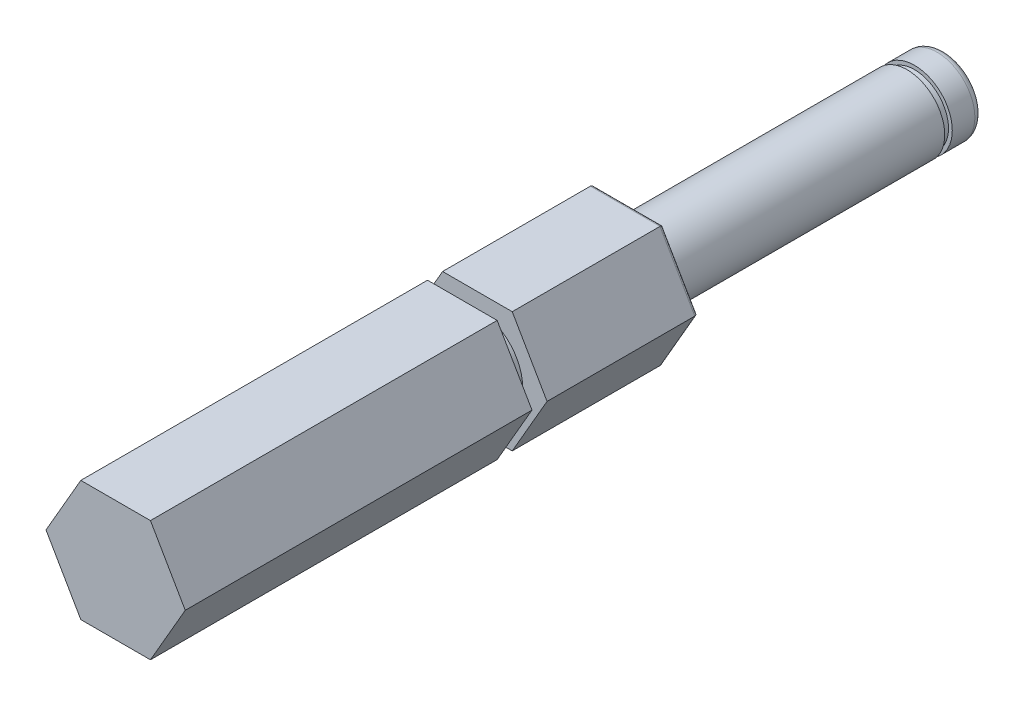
ISO-10303-21;
HEADER;
FILE_DESCRIPTION(('STEP AP214'),'2;1');
FILE_NAME('part.step','',(''),(''),'','','');
FILE_SCHEMA(('AUTOMOTIVE_DESIGN { 1 0 10303 214 1 1 1 1 }'));
ENDSEC;
DATA;
#1=APPLICATION_CONTEXT('core data for automotive mechanical design processes');
#2=APPLICATION_PROTOCOL_DEFINITION('international standard','automotive_design',2000,#1);
#3=PRODUCT_CONTEXT('',#1,'mechanical');
#4=PRODUCT('Part','Part','',(#3));
#5=PRODUCT_RELATED_PRODUCT_CATEGORY('part','',(#4));
#6=PRODUCT_DEFINITION_FORMATION('','',#4);
#7=PRODUCT_DEFINITION_CONTEXT('part definition',#1,'design');
#8=PRODUCT_DEFINITION('design','',#6,#7);
#9=PRODUCT_DEFINITION_SHAPE('','',#8);
#10=(LENGTH_UNIT() NAMED_UNIT(*) SI_UNIT(.MILLI.,.METRE.));
#11=(NAMED_UNIT(*) PLANE_ANGLE_UNIT() SI_UNIT($,.RADIAN.));
#12=(NAMED_UNIT(*) SI_UNIT($,.STERADIAN.) SOLID_ANGLE_UNIT());
#13=UNCERTAINTY_MEASURE_WITH_UNIT(LENGTH_MEASURE(1.E-05),#10,'distance_accuracy_value','');
#14=(GEOMETRIC_REPRESENTATION_CONTEXT(3) GLOBAL_UNCERTAINTY_ASSIGNED_CONTEXT((#13)) GLOBAL_UNIT_ASSIGNED_CONTEXT((#10,
#11,#12)) REPRESENTATION_CONTEXT('',''));
#15=CARTESIAN_POINT('',(0.,0.,0.));
#16=DIRECTION('',(0.,0.,1.));
#17=DIRECTION('',(1.,0.,0.));
#18=AXIS2_PLACEMENT_3D('',#15,#16,#17);
#19=CARTESIAN_POINT('',(0.,0.,-55.));
#20=DIRECTION('',(0.,0.,1.));
#21=DIRECTION('',(1.,0.,0.));
#22=AXIS2_PLACEMENT_3D('',#19,#20,#21);
#23=CYLINDRICAL_SURFACE('',#22,2.5);
#24=CARTESIAN_POINT('',(0.,0.,-52.5));
#25=DIRECTION('',(0.,0.,1.));
#26=DIRECTION('',(1.,0.,0.));
#27=AXIS2_PLACEMENT_3D('',#24,#25,#26);
#28=CIRCLE('',#27,2.5);
#29=CARTESIAN_POINT('',(2.5,0.,-52.5));
#30=VERTEX_POINT('',#29);
#31=EDGE_CURVE('E483',#30,#30,#28,.T.);
#32=CARTESIAN_POINT('',(0.,0.,-34.));
#33=DIRECTION('',(0.,0.,1.));
#34=DIRECTION('',(1.,0.,0.));
#35=AXIS2_PLACEMENT_3D('',#32,#33,#34);
#36=CIRCLE('',#35,2.5);
#37=CARTESIAN_POINT('',(2.5,0.,-34.));
#38=VERTEX_POINT('',#37);
#39=EDGE_CURVE('E236',#38,#38,#36,.F.);
#40=CARTESIAN_POINT('',(2.5,0.,-52.5));
#41=CARTESIAN_POINT('',(2.5,0.,-52.3072916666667));
#42=CARTESIAN_POINT('',(2.5,0.,-52.1145833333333));
#43=CARTESIAN_POINT('',(2.5,0.,-51.7291666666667));
#44=CARTESIAN_POINT('',(2.5,0.,-51.5364583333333));
#45=CARTESIAN_POINT('',(2.5,0.,-51.1510416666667));
#46=CARTESIAN_POINT('',(2.5,0.,-50.9583333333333));
#47=CARTESIAN_POINT('',(2.5,0.,-50.5729166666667));
#48=CARTESIAN_POINT('',(2.5,0.,-50.3802083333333));
#49=CARTESIAN_POINT('',(2.5,0.,-49.9947916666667));
#50=CARTESIAN_POINT('',(2.5,0.,-49.8020833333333));
#51=CARTESIAN_POINT('',(2.5,0.,-49.4166666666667));
#52=CARTESIAN_POINT('',(2.5,0.,-49.2239583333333));
#53=CARTESIAN_POINT('',(2.5,0.,-48.8385416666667));
#54=CARTESIAN_POINT('',(2.5,0.,-48.6458333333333));
#55=CARTESIAN_POINT('',(2.5,0.,-48.2604166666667));
#56=CARTESIAN_POINT('',(2.5,0.,-48.0677083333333));
#57=CARTESIAN_POINT('',(2.5,0.,-47.6822916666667));
#58=CARTESIAN_POINT('',(2.5,0.,-47.4895833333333));
#59=CARTESIAN_POINT('',(2.5,0.,-47.1041666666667));
#60=CARTESIAN_POINT('',(2.5,0.,-46.9114583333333));
#61=CARTESIAN_POINT('',(2.5,0.,-46.5260416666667));
#62=CARTESIAN_POINT('',(2.5,0.,-46.3333333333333));
#63=CARTESIAN_POINT('',(2.5,0.,-45.9479166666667));
#64=CARTESIAN_POINT('',(2.5,0.,-45.7552083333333));
#65=CARTESIAN_POINT('',(2.5,0.,-45.3697916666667));
#66=CARTESIAN_POINT('',(2.5,0.,-45.1770833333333));
#67=CARTESIAN_POINT('',(2.5,0.,-44.7916666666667));
#68=CARTESIAN_POINT('',(2.5,0.,-44.5989583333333));
#69=CARTESIAN_POINT('',(2.5,0.,-44.2135416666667));
#70=CARTESIAN_POINT('',(2.5,0.,-44.0208333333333));
#71=CARTESIAN_POINT('',(2.5,0.,-43.6354166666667));
#72=CARTESIAN_POINT('',(2.5,0.,-43.4427083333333));
#73=CARTESIAN_POINT('',(2.5,0.,-43.0572916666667));
#74=CARTESIAN_POINT('',(2.5,0.,-42.8645833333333));
#75=CARTESIAN_POINT('',(2.5,0.,-42.4791666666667));
#76=CARTESIAN_POINT('',(2.5,0.,-42.2864583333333));
#77=CARTESIAN_POINT('',(2.5,0.,-41.9010416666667));
#78=CARTESIAN_POINT('',(2.5,0.,-41.7083333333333));
#79=CARTESIAN_POINT('',(2.5,0.,-41.3229166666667));
#80=CARTESIAN_POINT('',(2.5,0.,-41.1302083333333));
#81=CARTESIAN_POINT('',(2.5,0.,-40.7447916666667));
#82=CARTESIAN_POINT('',(2.5,0.,-40.5520833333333));
#83=CARTESIAN_POINT('',(2.5,0.,-40.1666666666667));
#84=CARTESIAN_POINT('',(2.5,0.,-39.9739583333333));
#85=CARTESIAN_POINT('',(2.5,0.,-39.5885416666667));
#86=CARTESIAN_POINT('',(2.5,0.,-39.3958333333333));
#87=CARTESIAN_POINT('',(2.5,0.,-39.0104166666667));
#88=CARTESIAN_POINT('',(2.5,0.,-38.8177083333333));
#89=CARTESIAN_POINT('',(2.5,0.,-38.4322916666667));
#90=CARTESIAN_POINT('',(2.5,0.,-38.2395833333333));
#91=CARTESIAN_POINT('',(2.5,0.,-37.8541666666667));
#92=CARTESIAN_POINT('',(2.5,0.,-37.6614583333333));
#93=CARTESIAN_POINT('',(2.5,0.,-37.2760416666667));
#94=CARTESIAN_POINT('',(2.5,0.,-37.0833333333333));
#95=CARTESIAN_POINT('',(2.5,0.,-36.6979166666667));
#96=CARTESIAN_POINT('',(2.5,0.,-36.5052083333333));
#97=CARTESIAN_POINT('',(2.5,0.,-36.1197916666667));
#98=CARTESIAN_POINT('',(2.5,0.,-35.9270833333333));
#99=CARTESIAN_POINT('',(2.5,0.,-35.5416666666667));
#100=CARTESIAN_POINT('',(2.5,0.,-35.3489583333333));
#101=CARTESIAN_POINT('',(2.5,0.,-34.9635416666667));
#102=CARTESIAN_POINT('',(2.5,0.,-34.7708333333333));
#103=CARTESIAN_POINT('',(2.5,0.,-34.3854166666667));
#104=CARTESIAN_POINT('',(2.5,0.,-34.1927083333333));
#105=CARTESIAN_POINT('',(2.5,0.,-34.));
#106=B_SPLINE_CURVE_WITH_KNOTS('',3,(#40,#41,#42,#43,#44,#45,#46,#47,#48,#49,#50,#51,#52,#53,
#54,#55,#56,#57,#58,#59,#60,#61,#62,#63,#64,#65,#66,#67,#68,#69,#70,#71,#72,#73,#74,#75,#76,#77,
#78,#79,#80,#81,#82,#83,#84,#85,#86,#87,#88,#89,#90,#91,#92,#93,#94,#95,#96,#97,#98,#99,#100,
#101,#102,#103,#104,#105),.UNSPECIFIED.,.F.,.F.,(4,2,2,2,2,2,2,2,2,2,2,2,2,2,2,2,2,2,2,2,2,2,2,
2,2,2,2,2,2,2,2,2,4),(0.,0.578125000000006,1.15625,1.734375,2.3125,2.890625,3.46875,
4.04687500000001,4.625,5.203125,5.78125,6.359375,6.9375,7.51562500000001,8.09375,8.671875,9.25,
9.828125,10.40625,10.984375,11.5625,12.140625,12.71875,13.296875,13.875,14.453125,15.03125,
15.609375,16.1875,16.765625,17.34375,17.921875,18.5),.UNSPECIFIED.);
#107=EDGE_CURVE('BSEAM24',#30,#38,#106,.T.);
#108=ORIENTED_EDGE('',*,*,#31,.T.);
#109=ORIENTED_EDGE('',*,*,#39,.T.);
#110=ORIENTED_EDGE('',*,*,#107,.T.);
#111=ORIENTED_EDGE('',*,*,#107,.F.);
#112=EDGE_LOOP('',(#108,#110,#109,#111));
#113=FACE_BOUND('',#112,.T.);
#114=ADVANCED_FACE('F24',(#113),#23,.T.);
#115=CARTESIAN_POINT('',(-2.30940107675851,-3.99999999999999,-34.));
#116=DIRECTION('',(0.,0.,1.));
#117=DIRECTION('',(1.,0.,0.));
#118=AXIS2_PLACEMENT_3D('',#115,#116,#117);
#119=PLANE('',#118);
#120=DIRECTION('',(0.5,-0.866025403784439,0.));
#121=VECTOR('',#120,1.);
#122=CARTESIAN_POINT('',(4.44559707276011,-0.0999999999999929,-34.));
#123=LINE('',#122,#121);
#124=CARTESIAN_POINT('',(2.19393102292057,3.80000000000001,-34.));
#125=VERTEX_POINT('',#124);
#126=CARTESIAN_POINT('',(4.38786204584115,0.,-34.));
#127=VERTEX_POINT('',#126);
#128=EDGE_CURVE('E243',#125,#127,#123,.T.);
#129=ORIENTED_EDGE('',*,*,#128,.T.);
#130=DIRECTION('',(-0.5,-0.866025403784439,0.));
#131=VECTOR('',#130,1.);
#132=CARTESIAN_POINT('',(0.981495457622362,-5.9,-34.));
#133=LINE('',#132,#131);
#134=CARTESIAN_POINT('',(2.19393102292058,-3.79999999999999,-34.));
#135=VERTEX_POINT('',#134);
#136=EDGE_CURVE('E249',#127,#135,#133,.T.);
#137=ORIENTED_EDGE('',*,*,#136,.T.);
#138=DIRECTION('',(-1.,0.,0.));
#139=VECTOR('',#138,1.);
#140=CARTESIAN_POINT('',(-2.30940107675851,-3.79999999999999,-34.));
#141=LINE('',#140,#139);
#142=CARTESIAN_POINT('',(-2.19393102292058,-3.79999999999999,-34.));
#143=VERTEX_POINT('',#142);
#144=EDGE_CURVE('E247',#135,#143,#141,.T.);
#145=ORIENTED_EDGE('',*,*,#144,.T.);
#146=DIRECTION('',(-0.5,0.866025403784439,0.));
#147=VECTOR('',#146,1.);
#148=CARTESIAN_POINT('',(-2.13619599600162,-3.9,-34.));
#149=LINE('',#148,#147);
#150=CARTESIAN_POINT('',(-4.38786204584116,0.,-34.));
#151=VERTEX_POINT('',#150);
#152=EDGE_CURVE('E245',#143,#151,#149,.T.);
#153=ORIENTED_EDGE('',*,*,#152,.T.);
#154=DIRECTION('',(0.5,0.866025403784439,0.));
#155=VECTOR('',#154,1.);
#156=CARTESIAN_POINT('',(-5.60029761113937,-2.1,-34.));
#157=LINE('',#156,#155);
#158=CARTESIAN_POINT('',(-2.19393102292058,3.80000000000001,-34.));
#159=VERTEX_POINT('',#158);
#160=EDGE_CURVE('E239',#151,#159,#157,.T.);
#161=ORIENTED_EDGE('',*,*,#160,.T.);
#162=DIRECTION('',(1.,0.,0.));
#163=VECTOR('',#162,1.);
#164=CARTESIAN_POINT('',(-2.30940107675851,3.80000000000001,-34.));
#165=LINE('',#164,#163);
#166=EDGE_CURVE('E241',#159,#125,#165,.T.);
#167=ORIENTED_EDGE('',*,*,#166,.T.);
#168=EDGE_LOOP('',(#129,#137,#145,#153,#161,#167));
#169=FACE_BOUND('',#168,.T.);
#170=ORIENTED_EDGE('',*,*,#39,.F.);
#171=EDGE_LOOP('',(#170));
#172=FACE_BOUND('',#171,.T.);
#173=ADVANCED_FACE('F283',(#169,#172),#119,.F.);
#174=CARTESIAN_POINT('',(6.9282032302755,4.00000000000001,-23.));
#175=DIRECTION('',(0.,0.,1.));
#176=DIRECTION('',(1.,0.,0.));
#177=AXIS2_PLACEMENT_3D('',#174,#175,#176);
#178=PLANE('',#177);
#179=DIRECTION('',(0.5,0.866025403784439,0.));
#180=VECTOR('',#179,1.);
#181=CARTESIAN_POINT('',(2.3094010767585,-3.99999999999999,-23.));
#182=LINE('',#181,#180);
#183=CARTESIAN_POINT('',(2.3094010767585,-3.99999999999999,-23.));
#184=VERTEX_POINT('',#183);
#185=CARTESIAN_POINT('',(4.618802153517,0.,-23.));
#186=VERTEX_POINT('',#185);
#187=EDGE_CURVE('E203',#184,#186,#182,.T.);
#188=ORIENTED_EDGE('',*,*,#187,.F.);
#189=DIRECTION('',(1.,0.,0.));
#190=VECTOR('',#189,1.);
#191=CARTESIAN_POINT('',(-2.30940107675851,-3.99999999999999,-23.));
#192=LINE('',#191,#190);
#193=CARTESIAN_POINT('',(-2.30940107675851,-3.99999999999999,-23.));
#194=VERTEX_POINT('',#193);
#195=EDGE_CURVE('E218',#194,#184,#192,.T.);
#196=ORIENTED_EDGE('',*,*,#195,.F.);
#197=DIRECTION('',(0.5,-0.866025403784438,0.));
#198=VECTOR('',#197,1.);
#199=CARTESIAN_POINT('',(-4.61880215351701,0.,-23.));
#200=LINE('',#199,#198);
#201=CARTESIAN_POINT('',(-4.61880215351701,0.,-23.));
#202=VERTEX_POINT('',#201);
#203=EDGE_CURVE('E215',#202,#194,#200,.T.);
#204=ORIENTED_EDGE('',*,*,#203,.F.);
#205=DIRECTION('',(-0.5,-0.866025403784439,0.));
#206=VECTOR('',#205,1.);
#207=CARTESIAN_POINT('',(-2.30940107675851,4.00000000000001,-23.));
#208=LINE('',#207,#206);
#209=CARTESIAN_POINT('',(-2.30940107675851,4.00000000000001,-23.));
#210=VERTEX_POINT('',#209);
#211=EDGE_CURVE('E212',#210,#202,#208,.T.);
#212=ORIENTED_EDGE('',*,*,#211,.F.);
#213=DIRECTION('',(-1.,0.,0.));
#214=VECTOR('',#213,1.);
#215=CARTESIAN_POINT('',(2.3094010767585,4.00000000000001,-23.));
#216=LINE('',#215,#214);
#217=CARTESIAN_POINT('',(2.3094010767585,4.00000000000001,-23.));
#218=VERTEX_POINT('',#217);
#219=EDGE_CURVE('E209',#218,#210,#216,.T.);
#220=ORIENTED_EDGE('',*,*,#219,.F.);
#221=DIRECTION('',(-0.5,0.866025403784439,0.));
#222=VECTOR('',#221,1.);
#223=CARTESIAN_POINT('',(4.618802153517,0.,-23.));
#224=LINE('',#223,#222);
#225=EDGE_CURVE('E206',#186,#218,#224,.T.);
#226=ORIENTED_EDGE('',*,*,#225,.F.);
#227=EDGE_LOOP('',(#188,#196,#204,#212,#220,#226));
#228=FACE_BOUND('',#227,.T.);
#229=CARTESIAN_POINT('',(0.,0.,-23.));
#230=DIRECTION('',(0.,0.,1.));
#231=DIRECTION('',(1.,0.,0.));
#232=AXIS2_PLACEMENT_3D('',#229,#230,#231);
#233=CIRCLE('',#232,3.);
#234=CARTESIAN_POINT('',(3.,0.,-23.));
#235=VERTEX_POINT('',#234);
#236=EDGE_CURVE('E224',#235,#235,#233,.F.);
#237=ORIENTED_EDGE('',*,*,#236,.F.);
#238=EDGE_LOOP('',(#237));
#239=FACE_BOUND('',#238,.T.);
#240=ADVANCED_FACE('F288',(#228,#239),#178,.F.);
#241=CARTESIAN_POINT('',(2.3094010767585,-3.99999999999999,-23.));
#242=DIRECTION('',(0.866025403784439,-0.5,0.));
#243=DIRECTION('',(0.5,0.866025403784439,0.));
#244=AXIS2_PLACEMENT_3D('',#241,#242,#243);
#245=PLANE('',#244);
#246=DIRECTION('',(0.5,0.866025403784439,0.));
#247=VECTOR('',#246,1.);
#248=CARTESIAN_POINT('',(2.3094010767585,-3.99999999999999,0.));
#249=LINE('',#248,#247);
#250=CARTESIAN_POINT('',(2.3094010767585,-3.99999999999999,0.));
#251=VERTEX_POINT('',#250);
#252=CARTESIAN_POINT('',(4.618802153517,0.,0.));
#253=VERTEX_POINT('',#252);
#254=EDGE_CURVE('E185',#251,#253,#249,.T.);
#255=ORIENTED_EDGE('',*,*,#254,.F.);
#256=DIRECTION('',(0.,0.,1.));
#257=VECTOR('',#256,1.);
#258=CARTESIAN_POINT('',(2.3094010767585,-3.99999999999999,-23.));
#259=LINE('',#258,#257);
#260=EDGE_CURVE('E222',#184,#251,#259,.T.);
#261=ORIENTED_EDGE('',*,*,#260,.F.);
#262=ORIENTED_EDGE('',*,*,#187,.T.);
#263=DIRECTION('',(0.,0.,1.));
#264=VECTOR('',#263,1.);
#265=CARTESIAN_POINT('',(4.618802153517,0.,-23.));
#266=LINE('',#265,#264);
#267=EDGE_CURVE('E221',#186,#253,#266,.T.);
#268=ORIENTED_EDGE('',*,*,#267,.T.);
#269=EDGE_LOOP('',(#255,#261,#262,#268));
#270=FACE_BOUND('',#269,.T.);
#271=ADVANCED_FACE('F26',(#270),#245,.T.);
#272=CARTESIAN_POINT('',(-2.30940107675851,-3.99999999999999,-23.));
#273=DIRECTION('',(0.,-1.,0.));
#274=DIRECTION('',(0.,0.,-1.));
#275=AXIS2_PLACEMENT_3D('',#272,#273,#274);
#276=PLANE('',#275);
#277=DIRECTION('',(1.,0.,0.));
#278=VECTOR('',#277,1.);
#279=CARTESIAN_POINT('',(-2.30940107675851,-3.99999999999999,0.));
#280=LINE('',#279,#278);
#281=CARTESIAN_POINT('',(-2.30940107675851,-3.99999999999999,0.));
#282=VERTEX_POINT('',#281);
#283=EDGE_CURVE('E200',#282,#251,#280,.T.);
#284=ORIENTED_EDGE('',*,*,#283,.F.);
#285=DIRECTION('',(0.,0.,1.));
#286=VECTOR('',#285,1.);
#287=CARTESIAN_POINT('',(-2.30940107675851,-3.99999999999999,-23.));
#288=LINE('',#287,#286);
#289=EDGE_CURVE('E225',#194,#282,#288,.T.);
#290=ORIENTED_EDGE('',*,*,#289,.F.);
#291=ORIENTED_EDGE('',*,*,#195,.T.);
#292=ORIENTED_EDGE('',*,*,#260,.T.);
#293=EDGE_LOOP('',(#284,#290,#291,#292));
#294=FACE_BOUND('',#293,.T.);
#295=ADVANCED_FACE('F328',(#294),#276,.T.);
#296=CARTESIAN_POINT('',(-4.61880215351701,0.,-23.));
#297=DIRECTION('',(-0.866025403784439,-0.5,0.));
#298=DIRECTION('',(0.5,-0.866025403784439,0.));
#299=AXIS2_PLACEMENT_3D('',#296,#297,#298);
#300=PLANE('',#299);
#301=DIRECTION('',(0.5,-0.866025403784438,0.));
#302=VECTOR('',#301,1.);
#303=CARTESIAN_POINT('',(-4.61880215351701,0.,0.));
#304=LINE('',#303,#302);
#305=CARTESIAN_POINT('',(-4.61880215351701,0.,0.));
#306=VERTEX_POINT('',#305);
#307=EDGE_CURVE('E197',#306,#282,#304,.T.);
#308=ORIENTED_EDGE('',*,*,#307,.F.);
#309=DIRECTION('',(0.,0.,1.));
#310=VECTOR('',#309,1.);
#311=CARTESIAN_POINT('',(-4.61880215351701,0.,-23.));
#312=LINE('',#311,#310);
#313=EDGE_CURVE('E227',#202,#306,#312,.T.);
#314=ORIENTED_EDGE('',*,*,#313,.F.);
#315=ORIENTED_EDGE('',*,*,#203,.T.);
#316=ORIENTED_EDGE('',*,*,#289,.T.);
#317=EDGE_LOOP('',(#308,#314,#315,#316));
#318=FACE_BOUND('',#317,.T.);
#319=ADVANCED_FACE('F331',(#318),#300,.T.);
#320=CARTESIAN_POINT('',(-2.30940107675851,4.00000000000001,-23.));
#321=DIRECTION('',(-0.866025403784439,0.5,0.));
#322=DIRECTION('',(-0.5,-0.866025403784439,0.));
#323=AXIS2_PLACEMENT_3D('',#320,#321,#322);
#324=PLANE('',#323);
#325=DIRECTION('',(-0.5,-0.866025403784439,0.));
#326=VECTOR('',#325,1.);
#327=CARTESIAN_POINT('',(-2.30940107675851,4.00000000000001,0.));
#328=LINE('',#327,#326);
#329=CARTESIAN_POINT('',(-2.30940107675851,4.00000000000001,0.));
#330=VERTEX_POINT('',#329);
#331=EDGE_CURVE('E194',#330,#306,#328,.T.);
#332=ORIENTED_EDGE('',*,*,#331,.F.);
#333=DIRECTION('',(0.,0.,1.));
#334=VECTOR('',#333,1.);
#335=CARTESIAN_POINT('',(-2.30940107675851,4.00000000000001,-23.));
#336=LINE('',#335,#334);
#337=EDGE_CURVE('E229',#210,#330,#336,.T.);
#338=ORIENTED_EDGE('',*,*,#337,.F.);
#339=ORIENTED_EDGE('',*,*,#211,.T.);
#340=ORIENTED_EDGE('',*,*,#313,.T.);
#341=EDGE_LOOP('',(#332,#338,#339,#340));
#342=FACE_BOUND('',#341,.T.);
#343=ADVANCED_FACE('F335',(#342),#324,.T.);
#344=CARTESIAN_POINT('',(2.3094010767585,4.00000000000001,-23.));
#345=DIRECTION('',(0.,1.,0.));
#346=DIRECTION('',(0.,0.,1.));
#347=AXIS2_PLACEMENT_3D('',#344,#345,#346);
#348=PLANE('',#347);
#349=DIRECTION('',(-1.,0.,0.));
#350=VECTOR('',#349,1.);
#351=CARTESIAN_POINT('',(2.3094010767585,4.00000000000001,0.));
#352=LINE('',#351,#350);
#353=CARTESIAN_POINT('',(2.3094010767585,4.00000000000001,0.));
#354=VERTEX_POINT('',#353);
#355=EDGE_CURVE('E191',#354,#330,#352,.T.);
#356=ORIENTED_EDGE('',*,*,#355,.F.);
#357=DIRECTION('',(0.,0.,1.));
#358=VECTOR('',#357,1.);
#359=CARTESIAN_POINT('',(2.3094010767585,4.00000000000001,-23.));
#360=LINE('',#359,#358);
#361=EDGE_CURVE('E231',#218,#354,#360,.T.);
#362=ORIENTED_EDGE('',*,*,#361,.F.);
#363=ORIENTED_EDGE('',*,*,#219,.T.);
#364=ORIENTED_EDGE('',*,*,#337,.T.);
#365=EDGE_LOOP('',(#356,#362,#363,#364));
#366=FACE_BOUND('',#365,.T.);
#367=ADVANCED_FACE('F339',(#366),#348,.T.);
#368=CARTESIAN_POINT('',(4.618802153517,0.,-23.));
#369=DIRECTION('',(0.866025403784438,0.5,0.));
#370=DIRECTION('',(-0.5,0.866025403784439,0.));
#371=AXIS2_PLACEMENT_3D('',#368,#369,#370);
#372=PLANE('',#371);
#373=DIRECTION('',(-0.5,0.866025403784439,0.));
#374=VECTOR('',#373,1.);
#375=CARTESIAN_POINT('',(4.618802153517,0.,0.));
#376=LINE('',#375,#374);
#377=EDGE_CURVE('E188',#253,#354,#376,.T.);
#378=ORIENTED_EDGE('',*,*,#377,.F.);
#379=ORIENTED_EDGE('',*,*,#267,.F.);
#380=ORIENTED_EDGE('',*,*,#225,.T.);
#381=ORIENTED_EDGE('',*,*,#361,.T.);
#382=EDGE_LOOP('',(#378,#379,#380,#381));
#383=FACE_BOUND('',#382,.T.);
#384=ADVANCED_FACE('F323',(#383),#372,.T.);
#385=CARTESIAN_POINT('',(6.9282032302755,4.00000000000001,0.));
#386=DIRECTION('',(0.,0.,1.));
#387=DIRECTION('',(1.,0.,0.));
#388=AXIS2_PLACEMENT_3D('',#385,#386,#387);
#389=PLANE('',#388);
#390=ORIENTED_EDGE('',*,*,#254,.T.);
#391=ORIENTED_EDGE('',*,*,#377,.T.);
#392=ORIENTED_EDGE('',*,*,#355,.T.);
#393=ORIENTED_EDGE('',*,*,#331,.T.);
#394=ORIENTED_EDGE('',*,*,#307,.T.);
#395=ORIENTED_EDGE('',*,*,#283,.T.);
#396=EDGE_LOOP('',(#390,#391,#392,#393,#394,#395));
#397=FACE_BOUND('',#396,.T.);
#398=ADVANCED_FACE('F319',(#397),#389,.T.);
#399=CARTESIAN_POINT('',(0.,0.,-24.));
#400=DIRECTION('',(0.,0.,1.));
#401=DIRECTION('',(1.,0.,0.));
#402=AXIS2_PLACEMENT_3D('',#399,#400,#401);
#403=CYLINDRICAL_SURFACE('',#402,3.);
#404=CARTESIAN_POINT('',(0.,0.,-24.));
#405=DIRECTION('',(0.,0.,-1.));
#406=DIRECTION('',(-1.,0.,0.));
#407=AXIS2_PLACEMENT_3D('',#404,#405,#406);
#408=CIRCLE('',#407,3.);
#409=CARTESIAN_POINT('',(-3.,0.,-24.));
#410=VERTEX_POINT('',#409);
#411=EDGE_CURVE('E142',#410,#410,#408,.T.);
#412=ORIENTED_EDGE('',*,*,#411,.F.);
#413=EDGE_LOOP('',(#412));
#414=FACE_BOUND('',#413,.T.);
#415=ORIENTED_EDGE('',*,*,#236,.T.);
#416=EDGE_LOOP('',(#415));
#417=FACE_BOUND('',#416,.T.);
#418=ADVANCED_FACE('F296',(#414,#417),#403,.T.);
#419=CARTESIAN_POINT('',(-2.30940107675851,-3.99999999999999,-24.));
#420=DIRECTION('',(0.,0.,1.));
#421=DIRECTION('',(1.,0.,0.));
#422=AXIS2_PLACEMENT_3D('',#419,#420,#421);
#423=PLANE('',#422);
#424=DIRECTION('',(-0.5,0.866025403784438,0.));
#425=VECTOR('',#424,1.);
#426=CARTESIAN_POINT('',(-4.61880215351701,0.,-24.));
#427=LINE('',#426,#425);
#428=CARTESIAN_POINT('',(-2.30940107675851,-3.99999999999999,-24.));
#429=VERTEX_POINT('',#428);
#430=CARTESIAN_POINT('',(-4.61880215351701,0.,-24.));
#431=VERTEX_POINT('',#430);
#432=EDGE_CURVE('E150',#429,#431,#427,.T.);
#433=ORIENTED_EDGE('',*,*,#432,.F.);
#434=DIRECTION('',(-1.,0.,0.));
#435=VECTOR('',#434,1.);
#436=CARTESIAN_POINT('',(-2.30940107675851,-3.99999999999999,-24.));
#437=LINE('',#436,#435);
#438=CARTESIAN_POINT('',(2.3094010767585,-3.99999999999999,-24.));
#439=VERTEX_POINT('',#438);
#440=EDGE_CURVE('E173',#439,#429,#437,.T.);
#441=ORIENTED_EDGE('',*,*,#440,.F.);
#442=DIRECTION('',(-0.5,-0.866025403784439,0.));
#443=VECTOR('',#442,1.);
#444=CARTESIAN_POINT('',(2.3094010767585,-3.99999999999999,-24.));
#445=LINE('',#444,#443);
#446=CARTESIAN_POINT('',(4.618802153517,0.,-24.));
#447=VERTEX_POINT('',#446);
#448=EDGE_CURVE('E170',#447,#439,#445,.T.);
#449=ORIENTED_EDGE('',*,*,#448,.F.);
#450=DIRECTION('',(0.5,-0.866025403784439,0.));
#451=VECTOR('',#450,1.);
#452=CARTESIAN_POINT('',(4.618802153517,0.,-24.));
#453=LINE('',#452,#451);
#454=CARTESIAN_POINT('',(2.3094010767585,4.00000000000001,-24.));
#455=VERTEX_POINT('',#454);
#456=EDGE_CURVE('E167',#455,#447,#453,.T.);
#457=ORIENTED_EDGE('',*,*,#456,.F.);
#458=DIRECTION('',(1.,0.,0.));
#459=VECTOR('',#458,1.);
#460=CARTESIAN_POINT('',(2.3094010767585,4.00000000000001,-24.));
#461=LINE('',#460,#459);
#462=CARTESIAN_POINT('',(-2.30940107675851,4.00000000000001,-24.));
#463=VERTEX_POINT('',#462);
#464=EDGE_CURVE('E153',#463,#455,#461,.T.);
#465=ORIENTED_EDGE('',*,*,#464,.F.);
#466=DIRECTION('',(0.5,0.866025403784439,0.));
#467=VECTOR('',#466,1.);
#468=CARTESIAN_POINT('',(-2.30940107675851,4.00000000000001,-24.));
#469=LINE('',#468,#467);
#470=EDGE_CURVE('E135',#431,#463,#469,.T.);
#471=ORIENTED_EDGE('',*,*,#470,.F.);
#472=EDGE_LOOP('',(#433,#441,#449,#457,#465,#471));
#473=FACE_BOUND('',#472,.T.);
#474=ORIENTED_EDGE('',*,*,#411,.T.);
#475=EDGE_LOOP('',(#474));
#476=FACE_BOUND('',#475,.T.);
#477=ADVANCED_FACE('F147',(#473,#476),#423,.T.);
#478=CARTESIAN_POINT('',(-4.61880215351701,0.,-34.));
#479=DIRECTION('',(0.866025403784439,0.5,0.));
#480=DIRECTION('',(-0.5,0.866025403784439,0.));
#481=AXIS2_PLACEMENT_3D('',#478,#479,#480);
#482=PLANE('',#481);
#483=DIRECTION('',(0.,0.,1.));
#484=VECTOR('',#483,1.);
#485=CARTESIAN_POINT('',(-4.61880215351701,0.,-34.));
#486=LINE('',#485,#484);
#487=CARTESIAN_POINT('',(-4.61880215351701,0.,-33.8));
#488=VERTEX_POINT('',#487);
#489=EDGE_CURVE('E132',#488,#431,#486,.T.);
#490=ORIENTED_EDGE('',*,*,#489,.F.);
#491=DIRECTION('',(-0.5,0.866025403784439,0.));
#492=VECTOR('',#491,1.);
#493=CARTESIAN_POINT('',(-4.61880215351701,0.,-33.8));
#494=LINE('',#493,#492);
#495=CARTESIAN_POINT('',(-2.30940107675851,-3.99999999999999,-33.8));
#496=VERTEX_POINT('',#495);
#497=EDGE_CURVE('E257',#488,#496,#494,.F.);
#498=ORIENTED_EDGE('',*,*,#497,.T.);
#499=DIRECTION('',(0.,0.,1.));
#500=VECTOR('',#499,1.);
#501=CARTESIAN_POINT('',(-2.30940107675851,-3.99999999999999,-34.));
#502=LINE('',#501,#500);
#503=EDGE_CURVE('E157',#496,#429,#502,.T.);
#504=ORIENTED_EDGE('',*,*,#503,.T.);
#505=ORIENTED_EDGE('',*,*,#432,.T.);
#506=EDGE_LOOP('',(#490,#498,#504,#505));
#507=FACE_BOUND('',#506,.T.);
#508=ADVANCED_FACE('F155',(#507),#482,.F.);
#509=CARTESIAN_POINT('',(-2.30940107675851,4.00000000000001,-34.));
#510=DIRECTION('',(0.866025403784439,-0.5,0.));
#511=DIRECTION('',(0.5,0.866025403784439,0.));
#512=AXIS2_PLACEMENT_3D('',#509,#510,#511);
#513=PLANE('',#512);
#514=DIRECTION('',(0.,0.,1.));
#515=VECTOR('',#514,1.);
#516=CARTESIAN_POINT('',(-2.30940107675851,4.00000000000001,-34.));
#517=LINE('',#516,#515);
#518=CARTESIAN_POINT('',(-2.30940107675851,4.00000000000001,-33.8));
#519=VERTEX_POINT('',#518);
#520=EDGE_CURVE('E143',#519,#463,#517,.T.);
#521=ORIENTED_EDGE('',*,*,#520,.F.);
#522=DIRECTION('',(0.5,0.866025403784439,0.));
#523=VECTOR('',#522,1.);
#524=CARTESIAN_POINT('',(-2.30940107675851,4.00000000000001,-33.8));
#525=LINE('',#524,#523);
#526=EDGE_CURVE('E138',#519,#488,#525,.F.);
#527=ORIENTED_EDGE('',*,*,#526,.T.);
#528=ORIENTED_EDGE('',*,*,#489,.T.);
#529=ORIENTED_EDGE('',*,*,#470,.T.);
#530=EDGE_LOOP('',(#521,#527,#528,#529));
#531=FACE_BOUND('',#530,.T.);
#532=ADVANCED_FACE('F134',(#531),#513,.F.);
#533=CARTESIAN_POINT('',(2.3094010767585,4.00000000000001,-34.));
#534=DIRECTION('',(0.,-1.,0.));
#535=DIRECTION('',(0.,0.,-1.));
#536=AXIS2_PLACEMENT_3D('',#533,#534,#535);
#537=PLANE('',#536);
#538=DIRECTION('',(0.,0.,1.));
#539=VECTOR('',#538,1.);
#540=CARTESIAN_POINT('',(2.3094010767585,4.00000000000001,-34.));
#541=LINE('',#540,#539);
#542=CARTESIAN_POINT('',(2.3094010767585,4.00000000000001,-33.8));
#543=VERTEX_POINT('',#542);
#544=EDGE_CURVE('E180',#543,#455,#541,.T.);
#545=ORIENTED_EDGE('',*,*,#544,.F.);
#546=DIRECTION('',(1.,0.,0.));
#547=VECTOR('',#546,1.);
#548=CARTESIAN_POINT('',(2.3094010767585,4.00000000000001,-33.8));
#549=LINE('',#548,#547);
#550=EDGE_CURVE('E39',#543,#519,#549,.F.);
#551=ORIENTED_EDGE('',*,*,#550,.T.);
#552=ORIENTED_EDGE('',*,*,#520,.T.);
#553=ORIENTED_EDGE('',*,*,#464,.T.);
#554=EDGE_LOOP('',(#545,#551,#552,#553));
#555=FACE_BOUND('',#554,.T.);
#556=ADVANCED_FACE('F310',(#555),#537,.F.);
#557=CARTESIAN_POINT('',(4.618802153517,0.,-34.));
#558=DIRECTION('',(-0.866025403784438,-0.5,0.));
#559=DIRECTION('',(0.5,-0.866025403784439,0.));
#560=AXIS2_PLACEMENT_3D('',#557,#558,#559);
#561=PLANE('',#560);
#562=DIRECTION('',(0.,0.,1.));
#563=VECTOR('',#562,1.);
#564=CARTESIAN_POINT('',(4.618802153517,0.,-34.));
#565=LINE('',#564,#563);
#566=CARTESIAN_POINT('',(4.618802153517,0.,-33.8));
#567=VERTEX_POINT('',#566);
#568=EDGE_CURVE('E178',#567,#447,#565,.T.);
#569=ORIENTED_EDGE('',*,*,#568,.F.);
#570=DIRECTION('',(0.5,-0.866025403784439,0.));
#571=VECTOR('',#570,1.);
#572=CARTESIAN_POINT('',(4.618802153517,0.,-33.8));
#573=LINE('',#572,#571);
#574=EDGE_CURVE('E47',#567,#543,#573,.F.);
#575=ORIENTED_EDGE('',*,*,#574,.T.);
#576=ORIENTED_EDGE('',*,*,#544,.T.);
#577=ORIENTED_EDGE('',*,*,#456,.T.);
#578=EDGE_LOOP('',(#569,#575,#576,#577));
#579=FACE_BOUND('',#578,.T.);
#580=ADVANCED_FACE('F306',(#579),#561,.F.);
#581=CARTESIAN_POINT('',(2.3094010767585,-3.99999999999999,-34.));
#582=DIRECTION('',(-0.866025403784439,0.5,0.));
#583=DIRECTION('',(-0.5,-0.866025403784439,0.));
#584=AXIS2_PLACEMENT_3D('',#581,#582,#583);
#585=PLANE('',#584);
#586=DIRECTION('',(0.,0.,1.));
#587=VECTOR('',#586,1.);
#588=CARTESIAN_POINT('',(2.3094010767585,-3.99999999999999,-34.));
#589=LINE('',#588,#587);
#590=CARTESIAN_POINT('',(2.3094010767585,-3.99999999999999,-33.8));
#591=VERTEX_POINT('',#590);
#592=EDGE_CURVE('E176',#591,#439,#589,.T.);
#593=ORIENTED_EDGE('',*,*,#592,.F.);
#594=DIRECTION('',(-0.5,-0.866025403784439,0.));
#595=VECTOR('',#594,1.);
#596=CARTESIAN_POINT('',(2.3094010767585,-3.99999999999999,-33.8));
#597=LINE('',#596,#595);
#598=EDGE_CURVE('E252',#591,#567,#597,.F.);
#599=ORIENTED_EDGE('',*,*,#598,.T.);
#600=ORIENTED_EDGE('',*,*,#568,.T.);
#601=ORIENTED_EDGE('',*,*,#448,.T.);
#602=EDGE_LOOP('',(#593,#599,#600,#601));
#603=FACE_BOUND('',#602,.T.);
#604=ADVANCED_FACE('F302',(#603),#585,.F.);
#605=CARTESIAN_POINT('',(-2.30940107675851,-3.99999999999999,-34.));
#606=DIRECTION('',(0.,1.,0.));
#607=DIRECTION('',(0.,0.,1.));
#608=AXIS2_PLACEMENT_3D('',#605,#606,#607);
#609=PLANE('',#608);
#610=ORIENTED_EDGE('',*,*,#503,.F.);
#611=DIRECTION('',(-1.,0.,0.));
#612=VECTOR('',#611,1.);
#613=CARTESIAN_POINT('',(-2.30940107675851,-3.99999999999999,-33.8));
#614=LINE('',#613,#612);
#615=EDGE_CURVE('E255',#496,#591,#614,.F.);
#616=ORIENTED_EDGE('',*,*,#615,.T.);
#617=ORIENTED_EDGE('',*,*,#592,.T.);
#618=ORIENTED_EDGE('',*,*,#440,.T.);
#619=EDGE_LOOP('',(#610,#616,#617,#618));
#620=FACE_BOUND('',#619,.T.);
#621=ADVANCED_FACE('F298',(#620),#609,.F.);
#622=CARTESIAN_POINT('',(-5.60029761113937,-2.1,-33.8));
#623=DIRECTION('',(0.5,0.866025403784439,0.));
#624=DIRECTION('',(-0.866025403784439,0.5,0.));
#625=AXIS2_PLACEMENT_3D('',#622,#623,#624);
#626=CYLINDRICAL_SURFACE('',#625,0.2);
#627=CARTESIAN_POINT('',(-4.38786204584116,0.,-33.8));
#628=DIRECTION('',(0.,1.,0.));
#629=DIRECTION('',(1.,0.,0.));
#630=AXIS2_PLACEMENT_3D('',#627,#628,#629);
#631=ELLIPSE('',#630,0.23094010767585,0.2);
#632=EDGE_CURVE('E162',#488,#151,#631,.F.);
#633=ORIENTED_EDGE('',*,*,#632,.F.);
#634=ORIENTED_EDGE('',*,*,#526,.F.);
#635=CARTESIAN_POINT('',(-2.19393102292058,3.80000000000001,-33.8));
#636=DIRECTION('',(0.866025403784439,0.5,0.));
#637=DIRECTION('',(-0.5,0.866025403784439,0.));
#638=AXIS2_PLACEMENT_3D('',#635,#636,#637);
#639=ELLIPSE('',#638,0.23094010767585,0.2);
#640=EDGE_CURVE('E159',#159,#519,#639,.T.);
#641=ORIENTED_EDGE('',*,*,#640,.F.);
#642=ORIENTED_EDGE('',*,*,#160,.F.);
#643=EDGE_LOOP('',(#633,#634,#641,#642));
#644=FACE_BOUND('',#643,.T.);
#645=ADVANCED_FACE('F301',(#644),#626,.T.);
#646=CARTESIAN_POINT('',(-2.30940107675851,3.80000000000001,-33.8));
#647=DIRECTION('',(1.,0.,0.));
#648=DIRECTION('',(0.,0.,-1.));
#649=AXIS2_PLACEMENT_3D('',#646,#647,#648);
#650=CYLINDRICAL_SURFACE('',#649,0.2);
#651=ORIENTED_EDGE('',*,*,#640,.T.);
#652=ORIENTED_EDGE('',*,*,#550,.F.);
#653=CARTESIAN_POINT('',(2.19393102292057,3.80000000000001,-33.8));
#654=DIRECTION('',(0.866025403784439,-0.5,0.));
#655=DIRECTION('',(0.5,0.866025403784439,0.));
#656=AXIS2_PLACEMENT_3D('',#653,#654,#655);
#657=ELLIPSE('',#656,0.23094010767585,0.2);
#658=EDGE_CURVE('E498',#125,#543,#657,.T.);
#659=ORIENTED_EDGE('',*,*,#658,.F.);
#660=ORIENTED_EDGE('',*,*,#166,.F.);
#661=EDGE_LOOP('',(#651,#652,#659,#660));
#662=FACE_BOUND('',#661,.T.);
#663=ADVANCED_FACE('F411',(#662),#650,.T.);
#664=CARTESIAN_POINT('',(-2.13619599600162,-3.9,-33.8));
#665=DIRECTION('',(-0.5,0.866025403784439,0.));
#666=DIRECTION('',(-0.866025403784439,-0.5,0.));
#667=AXIS2_PLACEMENT_3D('',#664,#665,#666);
#668=CYLINDRICAL_SURFACE('',#667,0.2);
#669=ORIENTED_EDGE('',*,*,#632,.T.);
#670=ORIENTED_EDGE('',*,*,#152,.F.);
#671=CARTESIAN_POINT('',(-2.19393102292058,-3.79999999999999,-33.8));
#672=DIRECTION('',(-0.866025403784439,0.5,0.));
#673=DIRECTION('',(0.5,0.866025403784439,0.));
#674=AXIS2_PLACEMENT_3D('',#671,#672,#673);
#675=ELLIPSE('',#674,0.23094010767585,0.2);
#676=EDGE_CURVE('E495',#496,#143,#675,.F.);
#677=ORIENTED_EDGE('',*,*,#676,.F.);
#678=ORIENTED_EDGE('',*,*,#497,.F.);
#679=EDGE_LOOP('',(#669,#670,#677,#678));
#680=FACE_BOUND('',#679,.T.);
#681=ADVANCED_FACE('F418',(#680),#668,.T.);
#682=CARTESIAN_POINT('',(4.44559707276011,-0.099999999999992,-33.8));
#683=DIRECTION('',(0.5,-0.866025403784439,0.));
#684=DIRECTION('',(0.866025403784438,0.5,0.));
#685=AXIS2_PLACEMENT_3D('',#682,#683,#684);
#686=CYLINDRICAL_SURFACE('',#685,0.2);
#687=ORIENTED_EDGE('',*,*,#658,.T.);
#688=ORIENTED_EDGE('',*,*,#574,.F.);
#689=CARTESIAN_POINT('',(4.38786204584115,0.,-33.8));
#690=DIRECTION('',(0.,-1.,0.));
#691=DIRECTION('',(1.,0.,0.));
#692=AXIS2_PLACEMENT_3D('',#689,#690,#691);
#693=ELLIPSE('',#692,0.23094010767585,0.2);
#694=EDGE_CURVE('E493',#127,#567,#693,.T.);
#695=ORIENTED_EDGE('',*,*,#694,.F.);
#696=ORIENTED_EDGE('',*,*,#128,.F.);
#697=EDGE_LOOP('',(#687,#688,#695,#696));
#698=FACE_BOUND('',#697,.T.);
#699=ADVANCED_FACE('F426',(#698),#686,.T.);
#700=CARTESIAN_POINT('',(-2.30940107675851,-3.79999999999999,-33.8));
#701=DIRECTION('',(-1.,0.,0.));
#702=DIRECTION('',(0.,0.,1.));
#703=AXIS2_PLACEMENT_3D('',#700,#701,#702);
#704=CYLINDRICAL_SURFACE('',#703,0.2);
#705=ORIENTED_EDGE('',*,*,#676,.T.);
#706=ORIENTED_EDGE('',*,*,#144,.F.);
#707=CARTESIAN_POINT('',(2.19393102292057,-3.79999999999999,-33.8));
#708=DIRECTION('',(-0.866025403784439,-0.5,0.));
#709=DIRECTION('',(-0.5,0.866025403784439,0.));
#710=AXIS2_PLACEMENT_3D('',#707,#708,#709);
#711=ELLIPSE('',#710,0.23094010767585,0.2);
#712=EDGE_CURVE('E491',#591,#135,#711,.F.);
#713=ORIENTED_EDGE('',*,*,#712,.F.);
#714=ORIENTED_EDGE('',*,*,#615,.F.);
#715=EDGE_LOOP('',(#705,#706,#713,#714));
#716=FACE_BOUND('',#715,.T.);
#717=ADVANCED_FACE('F434',(#716),#704,.T.);
#718=CARTESIAN_POINT('',(0.981495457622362,-5.9,-33.8));
#719=DIRECTION('',(-0.5,-0.866025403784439,0.));
#720=DIRECTION('',(0.866025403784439,-0.5,0.));
#721=AXIS2_PLACEMENT_3D('',#718,#719,#720);
#722=CYLINDRICAL_SURFACE('',#721,0.2);
#723=ORIENTED_EDGE('',*,*,#694,.T.);
#724=ORIENTED_EDGE('',*,*,#598,.F.);
#725=ORIENTED_EDGE('',*,*,#712,.T.);
#726=ORIENTED_EDGE('',*,*,#136,.F.);
#727=EDGE_LOOP('',(#723,#724,#725,#726));
#728=FACE_BOUND('',#727,.T.);
#729=ADVANCED_FACE('F442',(#728),#722,.T.);
#730=CARTESIAN_POINT('',(0.,0.,-39.786734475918));
#731=DIRECTION('',(0.,0.,1.));
#732=DIRECTION('',(1.,0.,0.));
#733=AXIS2_PLACEMENT_3D('',#730,#731,#732);
#734=CYLINDRICAL_SURFACE('',#733,2.25);
#735=CARTESIAN_POINT('',(0.,0.,-52.5));
#736=DIRECTION('',(0.,0.,1.));
#737=DIRECTION('',(1.,0.,0.));
#738=AXIS2_PLACEMENT_3D('',#735,#736,#737);
#739=CIRCLE('',#738,2.25);
#740=CARTESIAN_POINT('',(2.25,0.,-52.5));
#741=VERTEX_POINT('',#740);
#742=EDGE_CURVE('E485',#741,#741,#739,.T.);
#743=ORIENTED_EDGE('',*,*,#742,.F.);
#744=EDGE_LOOP('',(#743));
#745=FACE_BOUND('',#744,.T.);
#746=CARTESIAN_POINT('',(0.,0.,-53.));
#747=DIRECTION('',(0.,0.,1.));
#748=DIRECTION('',(1.,0.,0.));
#749=AXIS2_PLACEMENT_3D('',#746,#747,#748);
#750=CIRCLE('',#749,2.25);
#751=CARTESIAN_POINT('',(2.25,0.,-53.));
#752=VERTEX_POINT('',#751);
#753=EDGE_CURVE('E479',#752,#752,#750,.T.);
#754=ORIENTED_EDGE('',*,*,#753,.T.);
#755=EDGE_LOOP('',(#754));
#756=FACE_BOUND('',#755,.T.);
#757=ADVANCED_FACE('F449',(#745,#756),#734,.T.);
#758=CARTESIAN_POINT('',(2.25,0.,-52.5));
#759=DIRECTION('',(0.,0.,1.));
#760=DIRECTION('',(1.,0.,0.));
#761=AXIS2_PLACEMENT_3D('',#758,#759,#760);
#762=PLANE('',#761);
#763=ORIENTED_EDGE('',*,*,#31,.F.);
#764=EDGE_LOOP('',(#763));
#765=FACE_BOUND('',#764,.T.);
#766=ORIENTED_EDGE('',*,*,#742,.T.);
#767=EDGE_LOOP('',(#766));
#768=FACE_BOUND('',#767,.T.);
#769=ADVANCED_FACE('F461',(#765,#768),#762,.F.);
#770=CARTESIAN_POINT('',(2.25,0.,-53.));
#771=DIRECTION('',(0.,0.,-1.));
#772=DIRECTION('',(-1.,0.,0.));
#773=AXIS2_PLACEMENT_3D('',#770,#771,#772);
#774=PLANE('',#773);
#775=ORIENTED_EDGE('',*,*,#753,.F.);
#776=EDGE_LOOP('',(#775));
#777=FACE_BOUND('',#776,.T.);
#778=CARTESIAN_POINT('',(0.,0.,-53.));
#779=DIRECTION('',(0.,0.,1.));
#780=DIRECTION('',(1.,0.,0.));
#781=AXIS2_PLACEMENT_3D('',#778,#779,#780);
#782=CIRCLE('',#781,2.5);
#783=CARTESIAN_POINT('',(2.5,0.,-53.));
#784=VERTEX_POINT('',#783);
#785=EDGE_CURVE('E482',#784,#784,#782,.T.);
#786=ORIENTED_EDGE('',*,*,#785,.T.);
#787=EDGE_LOOP('',(#786));
#788=FACE_BOUND('',#787,.T.);
#789=ADVANCED_FACE('F277',(#777,#788),#774,.F.);
#790=CARTESIAN_POINT('',(0.,0.,-55.));
#791=DIRECTION('',(0.,0.,-1.));
#792=DIRECTION('',(-1.,0.,0.));
#793=AXIS2_PLACEMENT_3D('',#790,#791,#792);
#794=PLANE('',#793);
#795=CARTESIAN_POINT('',(0.,0.,-55.));
#796=DIRECTION('',(0.,0.,-1.));
#797=DIRECTION('',(-1.,0.,0.));
#798=AXIS2_PLACEMENT_3D('',#795,#796,#797);
#799=CIRCLE('',#798,2.);
#800=CARTESIAN_POINT('',(-2.,0.,-55.));
#801=VERTEX_POINT('',#800);
#802=EDGE_CURVE('E32',#801,#801,#799,.T.);
#803=ORIENTED_EDGE('',*,*,#802,.T.);
#804=EDGE_LOOP('',(#803));
#805=FACE_BOUND('',#804,.T.);
#806=ADVANCED_FACE('F264',(#805),#794,.T.);
#807=CARTESIAN_POINT('',(0.,0.,-54.5));
#808=DIRECTION('',(0.,0.,-1.));
#809=DIRECTION('',(-1.,0.,0.));
#810=AXIS2_PLACEMENT_3D('',#807,#808,#809);
#811=TOROIDAL_SURFACE('',#810,2.,0.5);
#812=CARTESIAN_POINT('',(0.,0.,-54.5));
#813=DIRECTION('',(0.,0.,-1.));
#814=DIRECTION('',(-1.,0.,0.));
#815=AXIS2_PLACEMENT_3D('',#812,#813,#814);
#816=CIRCLE('',#815,2.5);
#817=CARTESIAN_POINT('',(2.5,0.,-54.5));
#818=VERTEX_POINT('',#817);
#819=EDGE_CURVE('E11',#818,#818,#816,.F.);
#820=ORIENTED_EDGE('',*,*,#819,.F.);
#821=EDGE_LOOP('',(#820));
#822=FACE_BOUND('',#821,.T.);
#823=ORIENTED_EDGE('',*,*,#802,.F.);
#824=EDGE_LOOP('',(#823));
#825=FACE_BOUND('',#824,.T.);
#826=ADVANCED_FACE('F266',(#822,#825),#811,.T.);
#827=CARTESIAN_POINT('',(2.5,0.,-53.));
#828=CARTESIAN_POINT('',(2.5,0.,-53.015625));
#829=CARTESIAN_POINT('',(2.5,0.,-53.03125));
#830=CARTESIAN_POINT('',(2.5,0.,-53.0625));
#831=CARTESIAN_POINT('',(2.5,0.,-53.078125));
#832=CARTESIAN_POINT('',(2.5,0.,-53.109375));
#833=CARTESIAN_POINT('',(2.5,0.,-53.125));
#834=CARTESIAN_POINT('',(2.5,0.,-53.15625));
#835=CARTESIAN_POINT('',(2.5,0.,-53.171875));
#836=CARTESIAN_POINT('',(2.5,0.,-53.203125));
#837=CARTESIAN_POINT('',(2.5,0.,-53.21875));
#838=CARTESIAN_POINT('',(2.5,0.,-53.25));
#839=CARTESIAN_POINT('',(2.5,0.,-53.265625));
#840=CARTESIAN_POINT('',(2.5,0.,-53.296875));
#841=CARTESIAN_POINT('',(2.5,0.,-53.3125));
#842=CARTESIAN_POINT('',(2.5,0.,-53.34375));
#843=CARTESIAN_POINT('',(2.5,0.,-53.359375));
#844=CARTESIAN_POINT('',(2.5,0.,-53.390625));
#845=CARTESIAN_POINT('',(2.5,0.,-53.40625));
#846=CARTESIAN_POINT('',(2.5,0.,-53.4375));
#847=CARTESIAN_POINT('',(2.5,0.,-53.453125));
#848=CARTESIAN_POINT('',(2.5,0.,-53.484375));
#849=CARTESIAN_POINT('',(2.5,0.,-53.5));
#850=CARTESIAN_POINT('',(2.5,0.,-53.53125));
#851=CARTESIAN_POINT('',(2.5,0.,-53.546875));
#852=CARTESIAN_POINT('',(2.5,0.,-53.578125));
#853=CARTESIAN_POINT('',(2.5,0.,-53.59375));
#854=CARTESIAN_POINT('',(2.5,0.,-53.625));
#855=CARTESIAN_POINT('',(2.5,0.,-53.640625));
#856=CARTESIAN_POINT('',(2.5,0.,-53.671875));
#857=CARTESIAN_POINT('',(2.5,0.,-53.6875));
#858=CARTESIAN_POINT('',(2.5,0.,-53.71875));
#859=CARTESIAN_POINT('',(2.5,0.,-53.734375));
#860=CARTESIAN_POINT('',(2.5,0.,-53.765625));
#861=CARTESIAN_POINT('',(2.5,0.,-53.78125));
#862=CARTESIAN_POINT('',(2.5,0.,-53.8125));
#863=CARTESIAN_POINT('',(2.5,0.,-53.828125));
#864=CARTESIAN_POINT('',(2.5,0.,-53.859375));
#865=CARTESIAN_POINT('',(2.5,0.,-53.875));
#866=CARTESIAN_POINT('',(2.5,0.,-53.90625));
#867=CARTESIAN_POINT('',(2.5,0.,-53.921875));
#868=CARTESIAN_POINT('',(2.5,0.,-53.953125));
#869=CARTESIAN_POINT('',(2.5,0.,-53.96875));
#870=CARTESIAN_POINT('',(2.5,0.,-54.));
#871=CARTESIAN_POINT('',(2.5,0.,-54.015625));
#872=CARTESIAN_POINT('',(2.5,0.,-54.046875));
#873=CARTESIAN_POINT('',(2.5,0.,-54.0625));
#874=CARTESIAN_POINT('',(2.5,0.,-54.09375));
#875=CARTESIAN_POINT('',(2.5,0.,-54.109375));
#876=CARTESIAN_POINT('',(2.5,0.,-54.140625));
#877=CARTESIAN_POINT('',(2.5,0.,-54.15625));
#878=CARTESIAN_POINT('',(2.5,0.,-54.1875));
#879=CARTESIAN_POINT('',(2.5,0.,-54.203125));
#880=CARTESIAN_POINT('',(2.5,0.,-54.234375));
#881=CARTESIAN_POINT('',(2.5,0.,-54.25));
#882=CARTESIAN_POINT('',(2.5,0.,-54.28125));
#883=CARTESIAN_POINT('',(2.5,0.,-54.296875));
#884=CARTESIAN_POINT('',(2.5,0.,-54.328125));
#885=CARTESIAN_POINT('',(2.5,0.,-54.34375));
#886=CARTESIAN_POINT('',(2.5,0.,-54.375));
#887=CARTESIAN_POINT('',(2.5,0.,-54.390625));
#888=CARTESIAN_POINT('',(2.5,0.,-54.421875));
#889=CARTESIAN_POINT('',(2.5,0.,-54.4375));
#890=CARTESIAN_POINT('',(2.5,0.,-54.46875));
#891=CARTESIAN_POINT('',(2.5,0.,-54.484375));
#892=CARTESIAN_POINT('',(2.5,0.,-54.5));
#893=B_SPLINE_CURVE_WITH_KNOTS('',3,(#827,#828,#829,#830,#831,#832,#833,#834,#835,#836,#837,
#838,#839,#840,#841,#842,#843,#844,#845,#846,#847,#848,#849,#850,#851,#852,#853,#854,#855,#856,
#857,#858,#859,#860,#861,#862,#863,#864,#865,#866,#867,#868,#869,#870,#871,#872,#873,#874,#875,
#876,#877,#878,#879,#880,#881,#882,#883,#884,#885,#886,#887,#888,#889,#890,#891,#892),
.UNSPECIFIED.,.F.,.F.,(4,2,2,2,2,2,2,2,2,2,2,2,2,2,2,2,2,2,2,2,2,2,2,2,2,2,2,2,2,2,2,2,4),(0.,
0.0468749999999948,0.0937499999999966,0.140624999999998,0.187499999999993,0.234374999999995,
0.281249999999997,0.328124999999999,0.374999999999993,0.421874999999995,0.468749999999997,
0.515624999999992,0.562499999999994,0.609374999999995,0.656249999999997,0.703124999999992,
0.749999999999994,0.796874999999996,0.84374999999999,0.890624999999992,0.937499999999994,
0.984374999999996,1.03124999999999,1.07812499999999,1.12499999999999,1.17187499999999,
1.21874999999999,1.26562499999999,1.31249999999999,1.35937499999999,1.40624999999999,
1.45312499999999,1.49999999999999),.UNSPECIFIED.);
#894=EDGE_CURVE('BSEAM268',#784,#818,#893,.T.);
#895=ORIENTED_EDGE('',*,*,#785,.F.);
#896=ORIENTED_EDGE('',*,*,#819,.T.);
#897=ORIENTED_EDGE('',*,*,#894,.T.);
#898=ORIENTED_EDGE('',*,*,#894,.F.);
#899=EDGE_LOOP('',(#895,#897,#896,#898));
#900=FACE_BOUND('',#899,.T.);
#901=ADVANCED_FACE('F268',(#900),#23,.T.);
#902=CLOSED_SHELL('',(#114,#173,#240,#271,#295,#319,#343,#367,#384,#398,#418,#477,#508,#532,
#556,#580,#604,#621,#645,#663,#681,#699,#717,#729,#757,#769,#789,#806,#826,#901));
#903=MANIFOLD_SOLID_BREP('B2',#902);
#904=ADVANCED_BREP_SHAPE_REPRESENTATION('',(#18,#903),#14);
#905=SHAPE_DEFINITION_REPRESENTATION(#9,#904);
ENDSEC;
END-ISO-10303-21;
